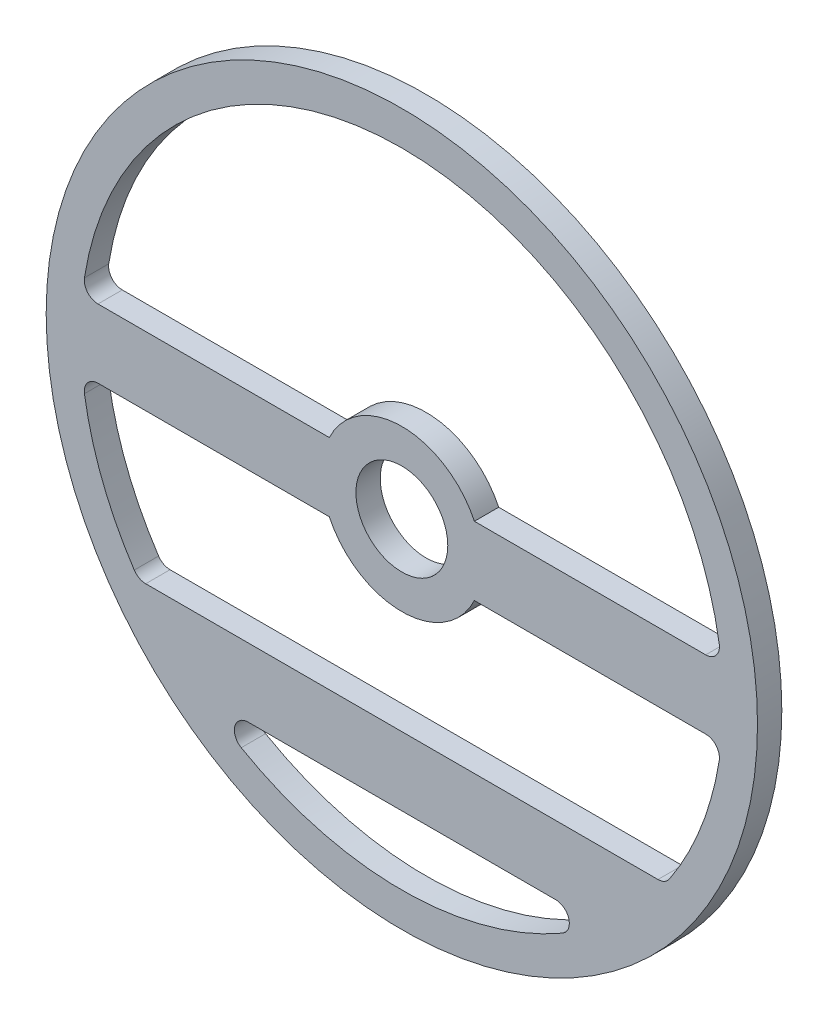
from build123d import *

# Parameters (mm, degrees)
SKETCH1_R           = 65.823354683
SKETCH1_R_2         = 59.473354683
BOSS_EXTRUDE2_DEPTH = 4.5
FILLET1_R           = 2.54


with BuildPart() as part:
    # Sketch1 → Boss-Extrude2 (new body)
    # profile 1 of 11: a face of its own
    with BuildSketch(Plane.XY):
        Circle(SKETCH1_R)
        Circle(SKETCH1_R_2, mode=Mode.SUBTRACT)
    # profile 2 of 11: a face of its own
    with BuildSketch(Plane.XY):
        with BuildLine():
            Line((13.423859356, -6.35), (59.133386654, -6.35))
            ThreePointArc((59.133386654, -6.35), (59.388301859, -3.179547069), (59.473354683, 0))
            ThreePointArc((59.473354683, 0), (59.388301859, 3.179547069), (59.133386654, 6.35))
            Line((59.133386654, 6.35), (13.423859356, 6.35))
            ThreePointArc((13.423859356, 6.35), (14.489078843, 3.254088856), (14.85, 0))
            ThreePointArc((14.85, 0), (14.489078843, -3.254088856), (13.423859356, -6.35))
        make_face()
    # profile 3 of 11: a face of its own
    with BuildSketch(Plane.XY):
        with BuildLine():
            ThreePointArc((-13.423859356, -6.35), (-7.944337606, -12.5463142), (0, -14.85))
            Line((0, -14.85), (0, -8.5))
            ThreePointArc((0, -8.5), (-8.5, 0), (0, 8.5))
            Line((0, 8.5), (0, 14.85))
            ThreePointArc((0, 14.85), (-7.944337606, 12.5463142), (-13.423859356, 6.35))
            ThreePointArc((-13.423859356, 6.35), (-14.85, 0), (-13.423859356, -6.35))
        make_face()
    # profile 4 of 11: a face of its own
    with BuildSketch(Plane.XY):
        with BuildLine():
            ThreePointArc((0, -14.85), (7.944337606, -12.5463142), (13.423859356, -6.35))
            ThreePointArc((13.423859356, -6.35), (14.489078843, -3.254088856), (14.85, 0))
            ThreePointArc((14.85, 0), (14.489078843, 3.254088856), (13.423859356, 6.35))
            ThreePointArc((13.423859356, 6.35), (7.944337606, 12.5463142), (0, 14.85))
            Line((0, 14.85), (0, 8.5))
            ThreePointArc((0, 8.5), (6.01040764, 6.01040764), (8.5, 0))
            ThreePointArc((8.5, 0), (6.01040764, -6.01040764), (0, -8.5))
            Line((0, -8.5), (0, -14.85))
        make_face()
    # profile 5 of 11: a face of its own
    with BuildSketch(Plane.XY):
        with BuildLine():
            ThreePointArc((-13.423859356, -6.35), (-7.944337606, -12.5463142), (0, -14.85))
            Line((0, -14.85), (0, -8.5))
            ThreePointArc((0, -8.5), (-8.5, 0), (0, 8.5))
            Line((0, 8.5), (0, 14.85))
            ThreePointArc((0, 14.85), (-7.944337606, 12.5463142), (-13.423859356, 6.35))
            ThreePointArc((-13.423859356, 6.35), (-14.85, 0), (-13.423859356, -6.35))
        make_face()
    # profile 6 of 11: a face of its own
    with BuildSketch(Plane.XY):
        with BuildLine():
            ThreePointArc((0, -14.85), (7.944337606, -12.5463142), (13.423859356, -6.35))
            ThreePointArc((13.423859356, -6.35), (14.489078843, -3.254088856), (14.85, 0))
            ThreePointArc((14.85, 0), (14.489078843, 3.254088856), (13.423859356, 6.35))
            ThreePointArc((13.423859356, 6.35), (7.944337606, 12.5463142), (0, 14.85))
            Line((0, 14.85), (0, 8.5))
            ThreePointArc((0, 8.5), (6.01040764, 6.01040764), (8.5, 0))
            ThreePointArc((8.5, 0), (6.01040764, -6.01040764), (0, -8.5))
            Line((0, -8.5), (0, -14.85))
        make_face()
    # profile 7 of 11: a face of its own
    with BuildSketch(Plane.XY):
        with BuildLine():
            Line((-59.133386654, -6.35), (-13.423859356, -6.35))
            ThreePointArc((-13.423859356, -6.35), (-14.85, 0), (-13.423859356, 6.35))
            Line((-13.423859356, 6.35), (-59.133386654, 6.35))
            ThreePointArc((-59.133386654, 6.35), (-59.473354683, 0), (-59.133386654, -6.35))
        make_face()
    # profile 8 of 11: a face of its own
    with BuildSketch(Plane.XY):
        with BuildLine():
            ThreePointArc((36.733271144, -46.773354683), (43.208346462, -40.86708594), (48.745116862, -34.073354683))
            Line((48.745116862, -34.073354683), (0, -34.073354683))
            Line((0, -34.073354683), (0, -46.773354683))
            Line((0, -46.773354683), (36.733271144, -46.773354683))
        make_face()
    # profile 9 of 11: a face of its own
    with BuildSketch(Plane.XY):
        with BuildLine():
            Line((0, -46.773354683), (0, -34.073354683))
            Line((0, -34.073354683), (-48.745116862, -34.073354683))
            ThreePointArc((-48.745116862, -34.073354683), (-43.208346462, -40.86708594), (-36.733271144, -46.773354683))
            Line((-36.733271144, -46.773354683), (0, -46.773354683))
        make_face()
    # profile 10 of 11: a face of its own
    with BuildSketch(Plane.XY):
        with BuildLine():
            ThreePointArc((36.733271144, -46.773354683), (43.208346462, -40.86708594), (48.745116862, -34.073354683))
            Line((48.745116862, -34.073354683), (0, -34.073354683))
            Line((0, -34.073354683), (0, -46.773354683))
            Line((0, -46.773354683), (36.733271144, -46.773354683))
        make_face()
    # profile 11 of 11: a face of its own
    with BuildSketch(Plane.XY):
        with BuildLine():
            Line((0, -46.773354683), (0, -34.073354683))
            Line((0, -34.073354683), (-48.745116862, -34.073354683))
            ThreePointArc((-48.745116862, -34.073354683), (-43.208346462, -40.86708594), (-36.733271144, -46.773354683))
            Line((-36.733271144, -46.773354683), (0, -46.773354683))
        make_face()
    extrude(amount=BOSS_EXTRUDE2_DEPTH)

    # Fillet1
    fillet1_edges = [part.edges().sort_by_distance(p)[0] for p in [
        (-59.133386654, -6.35, 2.25),
        (-48.745116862, -34.073354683, 2.25),
        (48.745116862, -34.073354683, 2.25),
        (59.133386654, -6.35, 2.25),
        (59.133386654, 6.35, 2.25),
        (-59.133386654, 6.35, 2.25),
        (-36.733271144, -46.773354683, 2.25),
        (36.733271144, -46.773354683, 2.25),
    ]]
    fillet(fillet1_edges, radius=FILLET1_R)


solid = part.part
